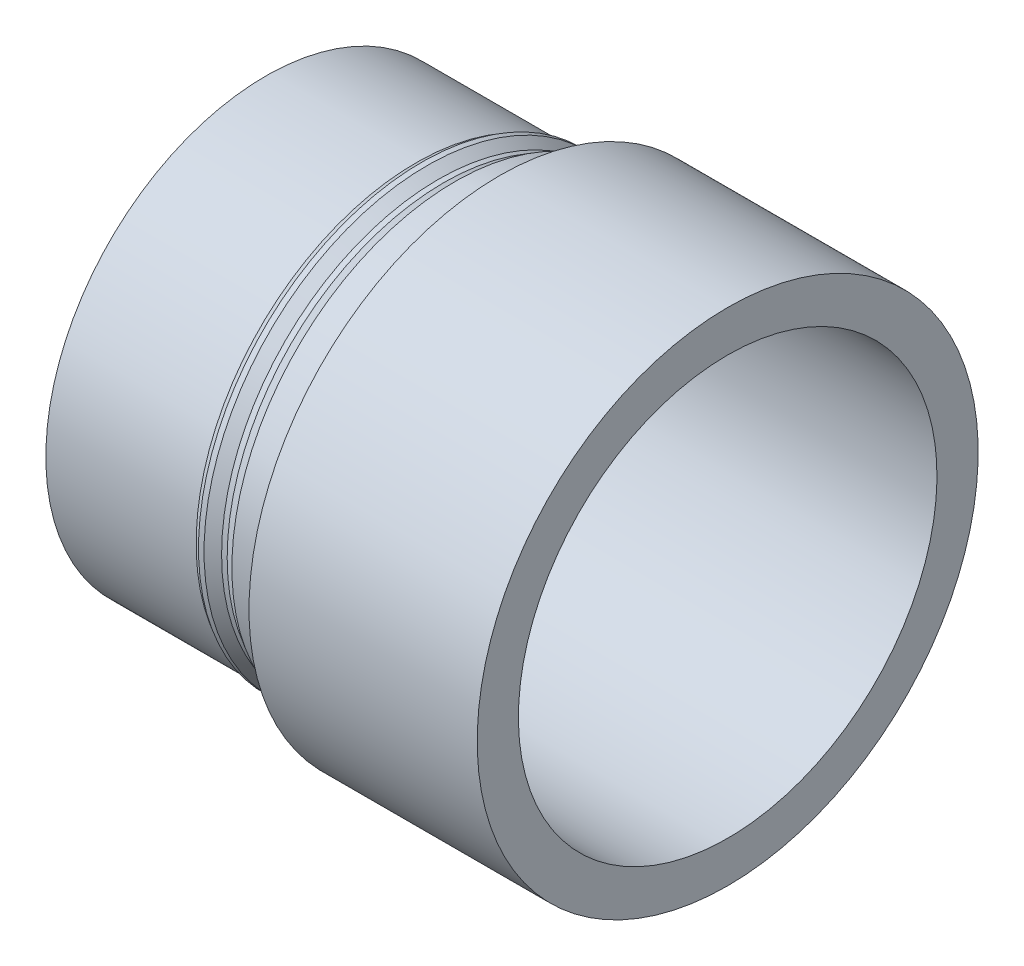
ISO-10303-21;
HEADER;
FILE_DESCRIPTION(('STEP AP214'),'2;1');
FILE_NAME('part.step','',(''),(''),'','','');
FILE_SCHEMA(('AUTOMOTIVE_DESIGN { 1 0 10303 214 1 1 1 1 }'));
ENDSEC;
DATA;
#1=APPLICATION_CONTEXT('core data for automotive mechanical design processes');
#2=APPLICATION_PROTOCOL_DEFINITION('international standard','automotive_design',2000,#1);
#3=PRODUCT_CONTEXT('',#1,'mechanical');
#4=PRODUCT('Part','Part','',(#3));
#5=PRODUCT_RELATED_PRODUCT_CATEGORY('part','',(#4));
#6=PRODUCT_DEFINITION_FORMATION('','',#4);
#7=PRODUCT_DEFINITION_CONTEXT('part definition',#1,'design');
#8=PRODUCT_DEFINITION('design','',#6,#7);
#9=PRODUCT_DEFINITION_SHAPE('','',#8);
#10=(LENGTH_UNIT() NAMED_UNIT(*) SI_UNIT(.MILLI.,.METRE.));
#11=(NAMED_UNIT(*) PLANE_ANGLE_UNIT() SI_UNIT($,.RADIAN.));
#12=(NAMED_UNIT(*) SI_UNIT($,.STERADIAN.) SOLID_ANGLE_UNIT());
#13=UNCERTAINTY_MEASURE_WITH_UNIT(LENGTH_MEASURE(1.E-05),#10,'distance_accuracy_value','');
#14=(GEOMETRIC_REPRESENTATION_CONTEXT(3) GLOBAL_UNCERTAINTY_ASSIGNED_CONTEXT((#13)) GLOBAL_UNIT_ASSIGNED_CONTEXT((#10,
#11,#12)) REPRESENTATION_CONTEXT('',''));
#15=CARTESIAN_POINT('',(0.,0.,0.));
#16=DIRECTION('',(0.,0.,1.));
#17=DIRECTION('',(1.,0.,0.));
#18=AXIS2_PLACEMENT_3D('',#15,#16,#17);
#19=CARTESIAN_POINT('',(0.,0.,0.));
#20=DIRECTION('',(-1.,0.,0.));
#21=DIRECTION('',(0.,0.,1.));
#22=AXIS2_PLACEMENT_3D('',#19,#20,#21);
#23=PLANE('',#22);
#24=CARTESIAN_POINT('',(0.,0.,0.));
#25=DIRECTION('',(1.,0.,0.));
#26=DIRECTION('',(0.,1.,0.));
#27=AXIS2_PLACEMENT_3D('',#24,#25,#26);
#28=CIRCLE('',#27,37.6);
#29=CARTESIAN_POINT('',(0.,37.6,0.));
#30=VERTEX_POINT('',#29);
#31=EDGE_CURVE('E69',#30,#30,#28,.T.);
#32=ORIENTED_EDGE('',*,*,#31,.T.);
#33=EDGE_LOOP('',(#32));
#34=FACE_BOUND('',#33,.T.);
#35=CARTESIAN_POINT('',(0.,0.,0.));
#36=DIRECTION('',(1.,0.,0.));
#37=DIRECTION('',(0.,0.,-1.));
#38=AXIS2_PLACEMENT_3D('',#35,#36,#37);
#39=CIRCLE('',#38,39.5);
#40=CARTESIAN_POINT('',(0.,0.,-39.5));
#41=VERTEX_POINT('',#40);
#42=EDGE_CURVE('E10',#41,#41,#39,.T.);
#43=ORIENTED_EDGE('',*,*,#42,.F.);
#44=EDGE_LOOP('',(#43));
#45=FACE_BOUND('',#44,.T.);
#46=ADVANCED_FACE('F31',(#34,#45),#23,.T.);
#47=CARTESIAN_POINT('',(42.,0.,0.));
#48=DIRECTION('',(1.,0.,0.));
#49=DIRECTION('',(0.,0.,-1.));
#50=AXIS2_PLACEMENT_3D('',#47,#48,#49);
#51=CYLINDRICAL_SURFACE('',#50,39.5);
#52=ORIENTED_EDGE('',*,*,#42,.T.);
#53=EDGE_LOOP('',(#52));
#54=FACE_BOUND('',#53,.T.);
#55=CARTESIAN_POINT('',(27.,0.,0.));
#56=DIRECTION('',(1.,0.,0.));
#57=DIRECTION('',(0.,0.,-1.));
#58=AXIS2_PLACEMENT_3D('',#55,#56,#57);
#59=CIRCLE('',#58,39.5);
#60=CARTESIAN_POINT('',(27.,0.,-39.5));
#61=VERTEX_POINT('',#60);
#62=EDGE_CURVE('E37',#61,#61,#59,.T.);
#63=ORIENTED_EDGE('',*,*,#62,.F.);
#64=EDGE_LOOP('',(#63));
#65=FACE_BOUND('',#64,.T.);
#66=ADVANCED_FACE('F106',(#54,#65),#51,.T.);
#67=CARTESIAN_POINT('',(28.,0.,0.));
#68=DIRECTION('',(1.,0.,0.));
#69=DIRECTION('',(0.,0.,-1.));
#70=AXIS2_PLACEMENT_3D('',#67,#68,#69);
#71=CONICAL_SURFACE('',#70,40.0773502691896,0.523598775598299);
#72=ORIENTED_EDGE('',*,*,#62,.T.);
#73=EDGE_LOOP('',(#72));
#74=FACE_BOUND('',#73,.T.);
#75=CARTESIAN_POINT('',(28.,0.,0.));
#76=DIRECTION('',(1.,0.,0.));
#77=DIRECTION('',(0.,0.,-1.));
#78=AXIS2_PLACEMENT_3D('',#75,#76,#77);
#79=CIRCLE('',#78,40.0773502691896);
#80=CARTESIAN_POINT('',(28.,0.,-40.0773502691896));
#81=VERTEX_POINT('',#80);
#82=EDGE_CURVE('E41',#81,#81,#79,.T.);
#83=ORIENTED_EDGE('',*,*,#82,.F.);
#84=EDGE_LOOP('',(#83));
#85=FACE_BOUND('',#84,.T.);
#86=ADVANCED_FACE('F110',(#74,#85),#71,.T.);
#87=CARTESIAN_POINT('',(42.,0.,0.));
#88=DIRECTION('',(1.,0.,0.));
#89=DIRECTION('',(0.,0.,-1.));
#90=AXIS2_PLACEMENT_3D('',#87,#88,#89);
#91=CYLINDRICAL_SURFACE('',#90,40.0773502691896);
#92=ORIENTED_EDGE('',*,*,#82,.T.);
#93=EDGE_LOOP('',(#92));
#94=FACE_BOUND('',#93,.T.);
#95=CARTESIAN_POINT('',(29.,0.,0.));
#96=DIRECTION('',(1.,0.,0.));
#97=DIRECTION('',(0.,0.,-1.));
#98=AXIS2_PLACEMENT_3D('',#95,#96,#97);
#99=CIRCLE('',#98,40.0773502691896);
#100=CARTESIAN_POINT('',(29.,0.,-40.0773502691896));
#101=VERTEX_POINT('',#100);
#102=EDGE_CURVE('E45',#101,#101,#99,.T.);
#103=ORIENTED_EDGE('',*,*,#102,.F.);
#104=EDGE_LOOP('',(#103));
#105=FACE_BOUND('',#104,.T.);
#106=ADVANCED_FACE('F114',(#94,#105),#91,.T.);
#107=CARTESIAN_POINT('',(31.,0.,0.));
#108=DIRECTION('',(-1.,0.,0.));
#109=DIRECTION('',(0.,0.,1.));
#110=AXIS2_PLACEMENT_3D('',#107,#108,#109);
#111=CONICAL_SURFACE('',#110,38.9226497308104,0.523598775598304);
#112=ORIENTED_EDGE('',*,*,#102,.T.);
#113=EDGE_LOOP('',(#112));
#114=FACE_BOUND('',#113,.T.);
#115=CARTESIAN_POINT('',(31.,0.,0.));
#116=DIRECTION('',(1.,0.,0.));
#117=DIRECTION('',(0.,0.,-1.));
#118=AXIS2_PLACEMENT_3D('',#115,#116,#117);
#119=CIRCLE('',#118,38.9226497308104);
#120=CARTESIAN_POINT('',(31.,0.,-38.9226497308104));
#121=VERTEX_POINT('',#120);
#122=EDGE_CURVE('E50',#121,#121,#119,.T.);
#123=ORIENTED_EDGE('',*,*,#122,.F.);
#124=EDGE_LOOP('',(#123));
#125=FACE_BOUND('',#124,.T.);
#126=ADVANCED_FACE('F120',(#114,#125),#111,.T.);
#127=CARTESIAN_POINT('',(42.,0.,0.));
#128=DIRECTION('',(1.,0.,0.));
#129=DIRECTION('',(0.,0.,-1.));
#130=AXIS2_PLACEMENT_3D('',#127,#128,#129);
#131=CYLINDRICAL_SURFACE('',#130,38.9226497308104);
#132=ORIENTED_EDGE('',*,*,#122,.T.);
#133=EDGE_LOOP('',(#132));
#134=FACE_BOUND('',#133,.T.);
#135=CARTESIAN_POINT('',(32.,0.,0.));
#136=DIRECTION('',(1.,0.,0.));
#137=DIRECTION('',(0.,0.,-1.));
#138=AXIS2_PLACEMENT_3D('',#135,#136,#137);
#139=CIRCLE('',#138,38.9226497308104);
#140=CARTESIAN_POINT('',(32.,0.,-38.9226497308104));
#141=VERTEX_POINT('',#140);
#142=EDGE_CURVE('E53',#141,#141,#139,.T.);
#143=ORIENTED_EDGE('',*,*,#142,.F.);
#144=EDGE_LOOP('',(#143));
#145=FACE_BOUND('',#144,.T.);
#146=ADVANCED_FACE('F124',(#134,#145),#131,.T.);
#147=CARTESIAN_POINT('',(34.,0.,0.));
#148=DIRECTION('',(1.,0.,0.));
#149=DIRECTION('',(0.,0.,-1.));
#150=AXIS2_PLACEMENT_3D('',#147,#148,#149);
#151=CONICAL_SURFACE('',#150,40.0773502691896,0.523598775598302);
#152=ORIENTED_EDGE('',*,*,#142,.T.);
#153=EDGE_LOOP('',(#152));
#154=FACE_BOUND('',#153,.T.);
#155=CARTESIAN_POINT('',(34.,0.,0.));
#156=DIRECTION('',(1.,0.,0.));
#157=DIRECTION('',(0.,0.,-1.));
#158=AXIS2_PLACEMENT_3D('',#155,#156,#157);
#159=CIRCLE('',#158,40.0773502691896);
#160=CARTESIAN_POINT('',(34.,0.,-40.0773502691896));
#161=VERTEX_POINT('',#160);
#162=EDGE_CURVE('E56',#161,#161,#159,.T.);
#163=ORIENTED_EDGE('',*,*,#162,.F.);
#164=EDGE_LOOP('',(#163));
#165=FACE_BOUND('',#164,.T.);
#166=ADVANCED_FACE('F128',(#154,#165),#151,.T.);
#167=CARTESIAN_POINT('',(42.,0.,0.));
#168=DIRECTION('',(1.,0.,0.));
#169=DIRECTION('',(0.,0.,-1.));
#170=AXIS2_PLACEMENT_3D('',#167,#168,#169);
#171=CYLINDRICAL_SURFACE('',#170,40.0773502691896);
#172=ORIENTED_EDGE('',*,*,#162,.T.);
#173=EDGE_LOOP('',(#172));
#174=FACE_BOUND('',#173,.T.);
#175=CARTESIAN_POINT('',(39.,0.,0.));
#176=DIRECTION('',(1.,0.,0.));
#177=DIRECTION('',(0.,0.,-1.));
#178=AXIS2_PLACEMENT_3D('',#175,#176,#177);
#179=CIRCLE('',#178,40.0773502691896);
#180=CARTESIAN_POINT('',(39.,0.,-40.0773502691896));
#181=VERTEX_POINT('',#180);
#182=EDGE_CURVE('E59',#181,#181,#179,.T.);
#183=ORIENTED_EDGE('',*,*,#182,.F.);
#184=EDGE_LOOP('',(#183));
#185=FACE_BOUND('',#184,.T.);
#186=ADVANCED_FACE('F132',(#174,#185),#171,.T.);
#187=CARTESIAN_POINT('',(42.,0.,0.));
#188=DIRECTION('',(1.,0.,0.));
#189=DIRECTION('',(0.,0.,-1.));
#190=AXIS2_PLACEMENT_3D('',#187,#188,#189);
#191=CONICAL_SURFACE('',#190,41.0773502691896,0.321750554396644);
#192=ORIENTED_EDGE('',*,*,#182,.T.);
#193=EDGE_LOOP('',(#192));
#194=FACE_BOUND('',#193,.T.);
#195=CARTESIAN_POINT('',(42.,0.,0.));
#196=DIRECTION('',(1.,0.,0.));
#197=DIRECTION('',(0.,0.,-1.));
#198=AXIS2_PLACEMENT_3D('',#195,#196,#197);
#199=CIRCLE('',#198,41.0773502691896);
#200=CARTESIAN_POINT('',(42.,0.,-41.0773502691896));
#201=VERTEX_POINT('',#200);
#202=EDGE_CURVE('E62',#201,#201,#199,.T.);
#203=ORIENTED_EDGE('',*,*,#202,.F.);
#204=EDGE_LOOP('',(#203));
#205=FACE_BOUND('',#204,.T.);
#206=ADVANCED_FACE('F96',(#194,#205),#191,.T.);
#207=CARTESIAN_POINT('',(83.,0.,0.));
#208=DIRECTION('',(-1.,0.,0.));
#209=DIRECTION('',(0.,-1.,0.));
#210=AXIS2_PLACEMENT_3D('',#207,#208,#209);
#211=CYLINDRICAL_SURFACE('',#210,45.);
#212=CARTESIAN_POINT('',(83.,0.,0.));
#213=DIRECTION('',(1.,0.,0.));
#214=DIRECTION('',(0.,1.,0.));
#215=AXIS2_PLACEMENT_3D('',#212,#213,#214);
#216=CIRCLE('',#215,45.);
#217=CARTESIAN_POINT('',(83.,45.,0.));
#218=VERTEX_POINT('',#217);
#219=EDGE_CURVE('E65',#218,#218,#216,.T.);
#220=ORIENTED_EDGE('',*,*,#219,.F.);
#221=EDGE_LOOP('',(#220));
#222=FACE_BOUND('',#221,.T.);
#223=CARTESIAN_POINT('',(42.,0.,0.));
#224=DIRECTION('',(1.,0.,0.));
#225=DIRECTION('',(0.,1.,0.));
#226=AXIS2_PLACEMENT_3D('',#223,#224,#225);
#227=CIRCLE('',#226,45.);
#228=CARTESIAN_POINT('',(42.,45.,0.));
#229=VERTEX_POINT('',#228);
#230=EDGE_CURVE('E66',#229,#229,#227,.T.);
#231=ORIENTED_EDGE('',*,*,#230,.T.);
#232=EDGE_LOOP('',(#231));
#233=FACE_BOUND('',#232,.T.);
#234=ADVANCED_FACE('F90',(#222,#233),#211,.T.);
#235=CARTESIAN_POINT('',(83.,0.,0.));
#236=DIRECTION('',(1.,0.,0.));
#237=DIRECTION('',(0.,1.,0.));
#238=AXIS2_PLACEMENT_3D('',#235,#236,#237);
#239=PLANE('',#238);
#240=CARTESIAN_POINT('',(83.,0.,0.));
#241=DIRECTION('',(1.,0.,0.));
#242=DIRECTION('',(0.,1.,0.));
#243=AXIS2_PLACEMENT_3D('',#240,#241,#242);
#244=CIRCLE('',#243,37.6);
#245=CARTESIAN_POINT('',(83.,37.6,0.));
#246=VERTEX_POINT('',#245);
#247=EDGE_CURVE('E72',#246,#246,#244,.T.);
#248=ORIENTED_EDGE('',*,*,#247,.F.);
#249=EDGE_LOOP('',(#248));
#250=FACE_BOUND('',#249,.T.);
#251=ORIENTED_EDGE('',*,*,#219,.T.);
#252=EDGE_LOOP('',(#251));
#253=FACE_BOUND('',#252,.T.);
#254=ADVANCED_FACE('F87',(#250,#253),#239,.T.);
#255=CARTESIAN_POINT('',(42.,0.,0.));
#256=DIRECTION('',(1.,0.,0.));
#257=DIRECTION('',(0.,1.,0.));
#258=AXIS2_PLACEMENT_3D('',#255,#256,#257);
#259=PLANE('',#258);
#260=ORIENTED_EDGE('',*,*,#202,.T.);
#261=EDGE_LOOP('',(#260));
#262=FACE_BOUND('',#261,.T.);
#263=ORIENTED_EDGE('',*,*,#230,.F.);
#264=EDGE_LOOP('',(#263));
#265=FACE_BOUND('',#264,.T.);
#266=ADVANCED_FACE('F83',(#262,#265),#259,.F.);
#267=CARTESIAN_POINT('',(0.,0.,0.));
#268=DIRECTION('',(1.,0.,0.));
#269=DIRECTION('',(0.,1.,0.));
#270=AXIS2_PLACEMENT_3D('',#267,#268,#269);
#271=CYLINDRICAL_SURFACE('',#270,37.6);
#272=CARTESIAN_POINT('',(0.,37.6,0.));
#273=CARTESIAN_POINT('',(0.864583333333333,37.6,0.));
#274=CARTESIAN_POINT('',(1.72916666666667,37.6,0.));
#275=CARTESIAN_POINT('',(3.45833333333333,37.6,0.));
#276=CARTESIAN_POINT('',(4.32291666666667,37.6,0.));
#277=CARTESIAN_POINT('',(6.05208333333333,37.6,0.));
#278=CARTESIAN_POINT('',(6.91666666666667,37.6,0.));
#279=CARTESIAN_POINT('',(8.64583333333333,37.6,0.));
#280=CARTESIAN_POINT('',(9.51041666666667,37.6,0.));
#281=CARTESIAN_POINT('',(11.2395833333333,37.6,0.));
#282=CARTESIAN_POINT('',(12.1041666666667,37.6,0.));
#283=CARTESIAN_POINT('',(13.8333333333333,37.6,0.));
#284=CARTESIAN_POINT('',(14.6979166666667,37.6,0.));
#285=CARTESIAN_POINT('',(16.4270833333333,37.6,0.));
#286=CARTESIAN_POINT('',(17.2916666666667,37.6,0.));
#287=CARTESIAN_POINT('',(19.0208333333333,37.6,0.));
#288=CARTESIAN_POINT('',(19.8854166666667,37.6,0.));
#289=CARTESIAN_POINT('',(21.6145833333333,37.6,0.));
#290=CARTESIAN_POINT('',(22.4791666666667,37.6,0.));
#291=CARTESIAN_POINT('',(24.2083333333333,37.6,0.));
#292=CARTESIAN_POINT('',(25.0729166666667,37.6,0.));
#293=CARTESIAN_POINT('',(26.8020833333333,37.6,0.));
#294=CARTESIAN_POINT('',(27.6666666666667,37.6,0.));
#295=CARTESIAN_POINT('',(29.3958333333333,37.6,0.));
#296=CARTESIAN_POINT('',(30.2604166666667,37.6,0.));
#297=CARTESIAN_POINT('',(31.9895833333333,37.6,0.));
#298=CARTESIAN_POINT('',(32.8541666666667,37.6,0.));
#299=CARTESIAN_POINT('',(34.5833333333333,37.6,0.));
#300=CARTESIAN_POINT('',(35.4479166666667,37.6,0.));
#301=CARTESIAN_POINT('',(37.1770833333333,37.6,0.));
#302=CARTESIAN_POINT('',(38.0416666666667,37.6,0.));
#303=CARTESIAN_POINT('',(39.7708333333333,37.6,0.));
#304=CARTESIAN_POINT('',(40.6354166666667,37.6,0.));
#305=CARTESIAN_POINT('',(42.3645833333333,37.6,0.));
#306=CARTESIAN_POINT('',(43.2291666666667,37.6,0.));
#307=CARTESIAN_POINT('',(44.9583333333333,37.6,0.));
#308=CARTESIAN_POINT('',(45.8229166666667,37.6,0.));
#309=CARTESIAN_POINT('',(47.5520833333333,37.6,0.));
#310=CARTESIAN_POINT('',(48.4166666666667,37.6,0.));
#311=CARTESIAN_POINT('',(50.1458333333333,37.6,0.));
#312=CARTESIAN_POINT('',(51.0104166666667,37.6,0.));
#313=CARTESIAN_POINT('',(52.7395833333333,37.6,0.));
#314=CARTESIAN_POINT('',(53.6041666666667,37.6,0.));
#315=CARTESIAN_POINT('',(55.3333333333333,37.6,0.));
#316=CARTESIAN_POINT('',(56.1979166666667,37.6,0.));
#317=CARTESIAN_POINT('',(57.9270833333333,37.6,0.));
#318=CARTESIAN_POINT('',(58.7916666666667,37.6,0.));
#319=CARTESIAN_POINT('',(60.5208333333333,37.6,0.));
#320=CARTESIAN_POINT('',(61.3854166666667,37.6,0.));
#321=CARTESIAN_POINT('',(63.1145833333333,37.6,0.));
#322=CARTESIAN_POINT('',(63.9791666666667,37.6,0.));
#323=CARTESIAN_POINT('',(65.7083333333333,37.6,0.));
#324=CARTESIAN_POINT('',(66.5729166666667,37.6,0.));
#325=CARTESIAN_POINT('',(68.3020833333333,37.6,0.));
#326=CARTESIAN_POINT('',(69.1666666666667,37.6,0.));
#327=CARTESIAN_POINT('',(70.8958333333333,37.6,0.));
#328=CARTESIAN_POINT('',(71.7604166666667,37.6,0.));
#329=CARTESIAN_POINT('',(73.4895833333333,37.6,0.));
#330=CARTESIAN_POINT('',(74.3541666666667,37.6,0.));
#331=CARTESIAN_POINT('',(76.0833333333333,37.6,0.));
#332=CARTESIAN_POINT('',(76.9479166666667,37.6,0.));
#333=CARTESIAN_POINT('',(78.6770833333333,37.6,0.));
#334=CARTESIAN_POINT('',(79.5416666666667,37.6,0.));
#335=CARTESIAN_POINT('',(81.2708333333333,37.6,0.));
#336=CARTESIAN_POINT('',(82.1354166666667,37.6,0.));
#337=CARTESIAN_POINT('',(83.,37.6,0.));
#338=B_SPLINE_CURVE_WITH_KNOTS('',3,(#272,#273,#274,#275,#276,#277,#278,#279,#280,#281,#282,
#283,#284,#285,#286,#287,#288,#289,#290,#291,#292,#293,#294,#295,#296,#297,#298,#299,#300,#301,
#302,#303,#304,#305,#306,#307,#308,#309,#310,#311,#312,#313,#314,#315,#316,#317,#318,#319,#320,
#321,#322,#323,#324,#325,#326,#327,#328,#329,#330,#331,#332,#333,#334,#335,#336,#337),
.UNSPECIFIED.,.F.,.F.,(4,2,2,2,2,2,2,2,2,2,2,2,2,2,2,2,2,2,2,2,2,2,2,2,2,2,2,2,2,2,2,2,4),(0.,
2.59375,5.1875,7.78125,10.375,12.96875,15.5625,18.15625,20.75,23.34375,25.9375,28.53125,31.125,
33.71875,36.3125,38.90625,41.5,44.09375,46.6875,49.28125,51.875,54.46875,57.0625,59.65625,62.25,
64.84375,67.4375,70.03125,72.625,75.21875,77.8125,80.40625,83.),.UNSPECIFIED.);
#339=EDGE_CURVE('BSEAM80',#30,#246,#338,.T.);
#340=ORIENTED_EDGE('',*,*,#31,.F.);
#341=ORIENTED_EDGE('',*,*,#247,.T.);
#342=ORIENTED_EDGE('',*,*,#339,.T.);
#343=ORIENTED_EDGE('',*,*,#339,.F.);
#344=EDGE_LOOP('',(#340,#342,#341,#343));
#345=FACE_BOUND('',#344,.T.);
#346=ADVANCED_FACE('F80',(#345),#271,.F.);
#347=CLOSED_SHELL('',(#46,#66,#86,#106,#126,#146,#166,#186,#206,#234,#254,#266,#346));
#348=MANIFOLD_SOLID_BREP('B2',#347);
#349=ADVANCED_BREP_SHAPE_REPRESENTATION('',(#18,#348),#14);
#350=SHAPE_DEFINITION_REPRESENTATION(#9,#349);
ENDSEC;
END-ISO-10303-21;
